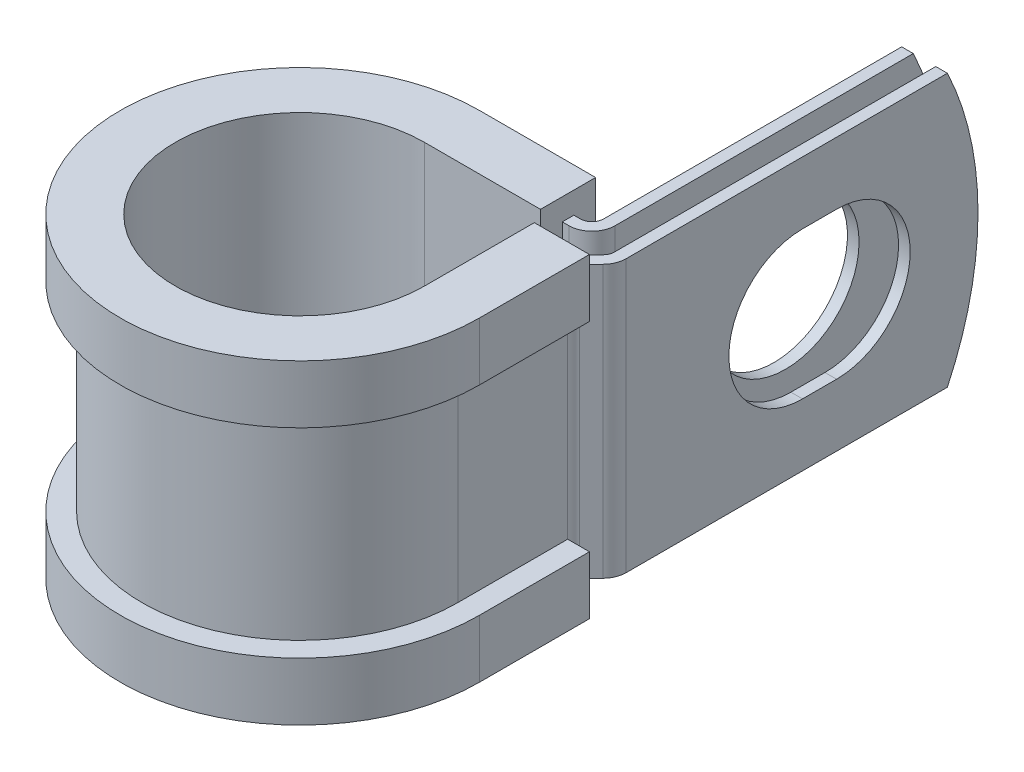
from build123d import *

# Parameters (mm, degrees)
EXTRUDE_THIN1_DEPTH = 9.525
SKETCH2_R           = 5.1562
CUT_EXTRUDE1_DEPTH  = 0.8128
CUT_EXTRUDE2_DEPTH  = 0.8128
CUT_EXTRUDE3_DEPTH  = 42.562692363


with BuildPart() as part:
    # Sketch1 → Extrude-Thin1 (new, symmetric)
    with BuildSketch(Plane(origin=(0, 0, 0), x_dir=(1, 0, 0), z_dir=(0, 1, 0))):
        with BuildLine():
            Line((11.789274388, 34.8996), (11.789274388, 10.2489))
            ThreePointArc((11.789274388, 10.2489), (11.727403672, 9.937854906), (11.55121078, 9.674163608))
            Line((11.55121078, 9.674163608), (10.725027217, 8.847980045))
            ThreePointArc((10.725027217, 8.847980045), (10.372641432, 8.320597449), (10.2489, 7.698507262))
            Line((10.2489, 7.698507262), (10.2489, 0))
            ThreePointArc((10.2489, 0), (-7.24706669, -7.24706669), (0, 10.2489))
            Line((0, 10.2489), (8.588874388, 10.2489))
            ThreePointArc((8.588874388, 10.2489), (9.738347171, 10.725027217), (10.214474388, 11.8745))
            Line((10.214474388, 11.8745), (10.214474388, 34.8996))
            Line((10.214474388, 34.8996), (9.401674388, 34.8996))
            Line((9.401674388, 34.8996), (9.401674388, 11.8745))
            ThreePointArc((9.401674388, 11.8745), (9.16361078, 11.299763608), (8.588874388, 11.0617))
            Line((8.588874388, 11.0617), (0, 11.0617))
            ThreePointArc((0, 11.0617), (-7.821803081, -7.821803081), (11.0617, 0))
            Line((11.0617, 0), (11.0617, 7.698507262))
            ThreePointArc((11.0617, 7.698507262), (11.123570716, 8.009552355), (11.299763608, 8.273243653))
            Line((11.299763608, 8.273243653), (12.125947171, 9.099427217))
            ThreePointArc((12.125947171, 9.099427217), (12.478332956, 9.626809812), (12.602074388, 10.2489))
            Line((12.602074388, 10.2489), (12.602074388, 34.8996))
            Line((12.602074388, 34.8996), (11.789274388, 34.8996))
        make_face()
    extrude(amount=EXTRUDE_THIN1_DEPTH, both=True)

    # Sketch2 → Cut-Extrude1 (cut)
    with BuildSketch(Plane.ZY.offset(-9.401674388)):
        with Locations((-23.7998, 0)):
            Circle(SKETCH2_R)
    extrude(amount=-CUT_EXTRUDE1_DEPTH, mode=Mode.SUBTRACT)

    # Sketch3 → Cut-Extrude2 (cut)
    with BuildSketch(Plane(origin=(12.602074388, 0, 0), x_dir=(0, 0, -1), z_dir=(1, 0, 0))):
        with BuildLine():
            Line((22.606, 5.1562), (24.9936, 5.1562))
            ThreePointArc((24.9936, 5.1562), (30.1498, 0), (24.9936, -5.1562))
            Line((24.9936, -5.1562), (22.606, -5.1562))
            ThreePointArc((22.606, -5.1562), (17.4498, 0), (22.606, 5.1562))
        make_face()
    extrude(amount=-CUT_EXTRUDE2_DEPTH, mode=Mode.SUBTRACT)

    # Sketch4 → Cut-Extrude3 (cut, through all)
    with BuildSketch(Plane.ZY.offset(-9.401674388)):
        with BuildLine():
            Line((-32.755063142, 9.525), (-34.8996, 9.525))
            Line((-34.8996, 9.525), (-34.8996, -2.73e-07))
            ThreePointArc((-34.8996, -2.73e-07), (-34.356838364, 4.881717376), (-32.755063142, 9.525))
        make_face()
        with BuildLine():
            ThreePointArc((-32.755063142, -9.525), (-34.356838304, -4.881717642), (-34.8996, -2.73e-07))
            Line((-34.8996, -2.73e-07), (-34.8996, -9.525))
            Line((-34.8996, -9.525), (-32.755063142, -9.525))
        make_face()
    extrude(amount=-CUT_EXTRUDE3_DEPTH, mode=Mode.SUBTRACT)

    # Sweep1: sweep along a path in Sketch6
    with BuildLine(Plane(origin=(0, 9.525, 0), x_dir=(1, 0, 0), z_dir=(0, 1, 0))) as sweep1_path:
        Line((8.7249, 7.698507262), (8.7249, 0))
        ThreePointArc((8.7249, 0), (-6.169435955, -6.169435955), (0, 8.7249))
        Line((0, 8.7249), (8.131674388, 8.7249))
    # Sketch5 → Sweep1 (sweep)
    with BuildSketch(Plane(origin=(0, 0, -7.698507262), x_dir=(-1, 0, 0), z_dir=(0, 0, -1))):
        Polygon((-11.0617, 9.525), (-10.2489, 9.525), (-10.2489, -9.525), (-11.0617, -9.525), (-11.0617, -6.985), (-12.5857, -6.985), (-12.5857, -11.049), (-8.7249, -11.049), (-8.7249, 11.049), (-12.5857, 11.049), (-12.5857, 6.985), (-11.0617, 6.985), align=None)
    sweep(path=sweep1_path.line)


solid = part.part
